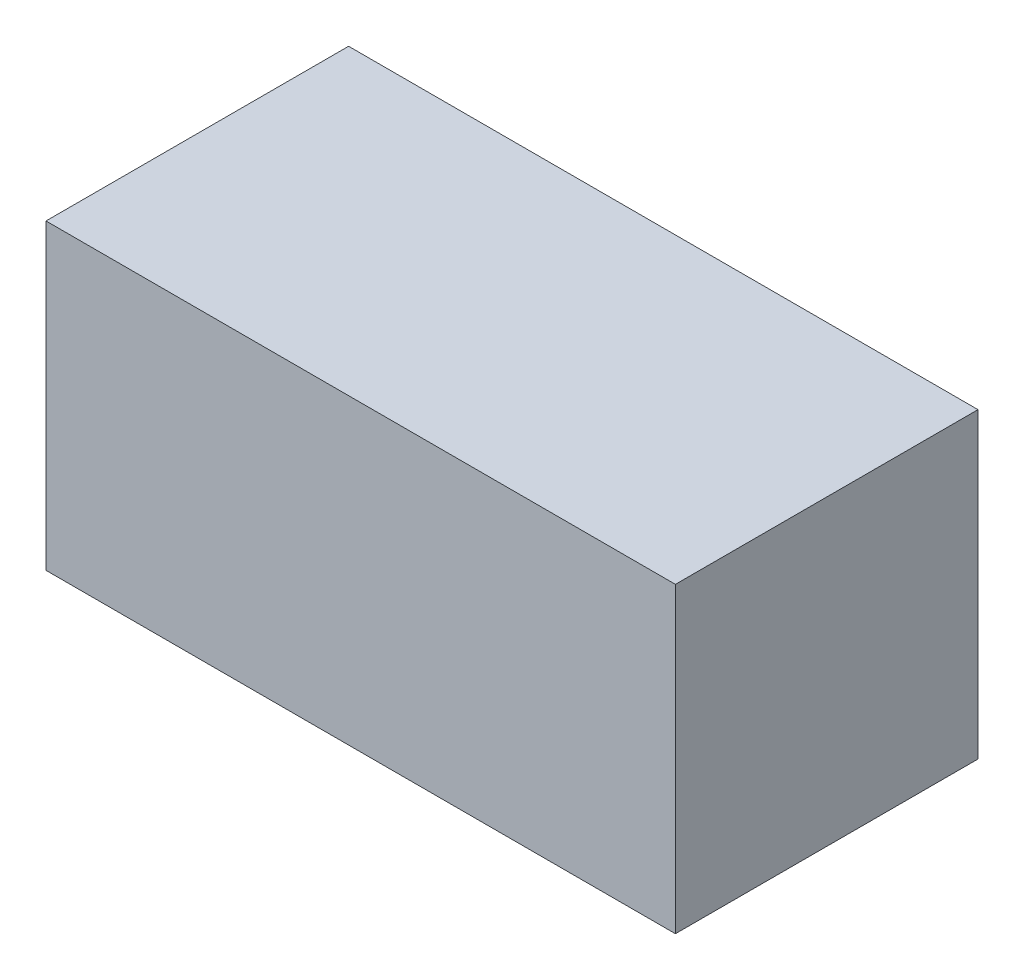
ISO-10303-21;
HEADER;
FILE_DESCRIPTION(('STEP AP214'),'2;1');
FILE_NAME('part.step','',(''),(''),'','','');
FILE_SCHEMA(('AUTOMOTIVE_DESIGN { 1 0 10303 214 1 1 1 1 }'));
ENDSEC;
DATA;
#1=APPLICATION_CONTEXT('core data for automotive mechanical design processes');
#2=APPLICATION_PROTOCOL_DEFINITION('international standard','automotive_design',2000,#1);
#3=PRODUCT_CONTEXT('',#1,'mechanical');
#4=PRODUCT('Part','Part','',(#3));
#5=PRODUCT_RELATED_PRODUCT_CATEGORY('part','',(#4));
#6=PRODUCT_DEFINITION_FORMATION('','',#4);
#7=PRODUCT_DEFINITION_CONTEXT('part definition',#1,'design');
#8=PRODUCT_DEFINITION('design','',#6,#7);
#9=PRODUCT_DEFINITION_SHAPE('','',#8);
#10=(LENGTH_UNIT() NAMED_UNIT(*) SI_UNIT(.MILLI.,.METRE.));
#11=(NAMED_UNIT(*) PLANE_ANGLE_UNIT() SI_UNIT($,.RADIAN.));
#12=(NAMED_UNIT(*) SI_UNIT($,.STERADIAN.) SOLID_ANGLE_UNIT());
#13=UNCERTAINTY_MEASURE_WITH_UNIT(LENGTH_MEASURE(1.E-05),#10,'distance_accuracy_value','');
#14=(GEOMETRIC_REPRESENTATION_CONTEXT(3) GLOBAL_UNCERTAINTY_ASSIGNED_CONTEXT((#13)) GLOBAL_UNIT_ASSIGNED_CONTEXT((#10,
#11,#12)) REPRESENTATION_CONTEXT('',''));
#15=CARTESIAN_POINT('',(0.,0.,0.));
#16=DIRECTION('',(0.,0.,1.));
#17=DIRECTION('',(1.,0.,0.));
#18=AXIS2_PLACEMENT_3D('',#15,#16,#17);
#19=CARTESIAN_POINT('',(0.51999896,-0.2499995,0.));
#20=DIRECTION('',(0.,-1.,0.));
#21=DIRECTION('',(0.,0.,-1.));
#22=AXIS2_PLACEMENT_3D('',#19,#20,#21);
#23=PLANE('',#22);
#24=DIRECTION('',(0.,0.,1.));
#25=VECTOR('',#24,1.);
#26=CARTESIAN_POINT('',(-0.51999896,-0.2499995,0.));
#27=LINE('',#26,#25);
#28=CARTESIAN_POINT('',(-0.51999896,-0.2499995,0.));
#29=VERTEX_POINT('',#28);
#30=CARTESIAN_POINT('',(-0.51999896,-0.2499995,0.5));
#31=VERTEX_POINT('',#30);
#32=EDGE_CURVE('E20',#29,#31,#27,.T.);
#33=ORIENTED_EDGE('',*,*,#32,.F.);
#34=DIRECTION('',(1.,0.,0.));
#35=VECTOR('',#34,1.);
#36=CARTESIAN_POINT('',(-0.51999896,-0.2499995,0.));
#37=LINE('',#36,#35);
#38=CARTESIAN_POINT('',(0.51999896,-0.2499995,0.));
#39=VERTEX_POINT('',#38);
#40=EDGE_CURVE('E79',#29,#39,#37,.T.);
#41=ORIENTED_EDGE('',*,*,#40,.T.);
#42=DIRECTION('',(0.,0.,-1.));
#43=VECTOR('',#42,1.);
#44=CARTESIAN_POINT('',(0.51999896,-0.2499995,0.));
#45=LINE('',#44,#43);
#46=CARTESIAN_POINT('',(0.51999896,-0.2499995,0.5));
#47=VERTEX_POINT('',#46);
#48=EDGE_CURVE('E61',#47,#39,#45,.T.);
#49=ORIENTED_EDGE('',*,*,#48,.F.);
#50=DIRECTION('',(1.,0.,0.));
#51=VECTOR('',#50,1.);
#52=CARTESIAN_POINT('',(-0.51999896,-0.2499995,0.5));
#53=LINE('',#52,#51);
#54=EDGE_CURVE('E56',#31,#47,#53,.T.);
#55=ORIENTED_EDGE('',*,*,#54,.F.);
#56=EDGE_LOOP('',(#33,#41,#49,#55));
#57=FACE_BOUND('',#56,.T.);
#58=ADVANCED_FACE('F17',(#57),#23,.T.);
#59=CARTESIAN_POINT('',(-0.51999896,-0.2499995,0.));
#60=DIRECTION('',(-1.,0.,0.));
#61=DIRECTION('',(0.,0.,1.));
#62=AXIS2_PLACEMENT_3D('',#59,#60,#61);
#63=PLANE('',#62);
#64=DIRECTION('',(0.,0.,1.));
#65=VECTOR('',#64,1.);
#66=CARTESIAN_POINT('',(-0.51999896,0.2499995,0.));
#67=LINE('',#66,#65);
#68=CARTESIAN_POINT('',(-0.51999896,0.2499995,0.));
#69=VERTEX_POINT('',#68);
#70=CARTESIAN_POINT('',(-0.51999896,0.2499995,0.5));
#71=VERTEX_POINT('',#70);
#72=EDGE_CURVE('E83',#69,#71,#67,.T.);
#73=ORIENTED_EDGE('',*,*,#72,.F.);
#74=DIRECTION('',(0.,1.,0.));
#75=VECTOR('',#74,1.);
#76=CARTESIAN_POINT('',(-0.51999896,-0.2499995,0.));
#77=LINE('',#76,#75);
#78=EDGE_CURVE('E68',#69,#29,#77,.F.);
#79=ORIENTED_EDGE('',*,*,#78,.T.);
#80=ORIENTED_EDGE('',*,*,#32,.T.);
#81=DIRECTION('',(0.,1.,0.));
#82=VECTOR('',#81,1.);
#83=CARTESIAN_POINT('',(-0.51999896,-0.2499995,0.5));
#84=LINE('',#83,#82);
#85=EDGE_CURVE('E63',#71,#31,#84,.F.);
#86=ORIENTED_EDGE('',*,*,#85,.F.);
#87=EDGE_LOOP('',(#73,#79,#80,#86));
#88=FACE_BOUND('',#87,.T.);
#89=ADVANCED_FACE('F65',(#88),#63,.T.);
#90=CARTESIAN_POINT('',(-0.51999896,-0.2499995,0.5));
#91=DIRECTION('',(0.,0.,1.));
#92=DIRECTION('',(1.,0.,0.));
#93=AXIS2_PLACEMENT_3D('',#90,#91,#92);
#94=PLANE('',#93);
#95=DIRECTION('',(1.,0.,0.));
#96=VECTOR('',#95,1.);
#97=CARTESIAN_POINT('',(-0.51999896,0.2499995,0.5));
#98=LINE('',#97,#96);
#99=CARTESIAN_POINT('',(0.51999896,0.2499995,0.5));
#100=VERTEX_POINT('',#99);
#101=EDGE_CURVE('E72',#71,#100,#98,.T.);
#102=ORIENTED_EDGE('',*,*,#101,.F.);
#103=ORIENTED_EDGE('',*,*,#85,.T.);
#104=ORIENTED_EDGE('',*,*,#54,.T.);
#105=DIRECTION('',(0.,1.,0.));
#106=VECTOR('',#105,1.);
#107=CARTESIAN_POINT('',(0.51999896,0.2499995,0.5));
#108=LINE('',#107,#106);
#109=EDGE_CURVE('E74',#100,#47,#108,.F.);
#110=ORIENTED_EDGE('',*,*,#109,.F.);
#111=EDGE_LOOP('',(#102,#103,#104,#110));
#112=FACE_BOUND('',#111,.T.);
#113=ADVANCED_FACE('F70',(#112),#94,.T.);
#114=CARTESIAN_POINT('',(0.51999896,0.2499995,0.));
#115=DIRECTION('',(1.,0.,0.));
#116=DIRECTION('',(0.,0.,-1.));
#117=AXIS2_PLACEMENT_3D('',#114,#115,#116);
#118=PLANE('',#117);
#119=ORIENTED_EDGE('',*,*,#48,.T.);
#120=DIRECTION('',(0.,1.,0.));
#121=VECTOR('',#120,1.);
#122=CARTESIAN_POINT('',(0.51999896,-0.2499995,0.));
#123=LINE('',#122,#121);
#124=CARTESIAN_POINT('',(0.51999896,0.2499995,0.));
#125=VERTEX_POINT('',#124);
#126=EDGE_CURVE('E35',#39,#125,#123,.T.);
#127=ORIENTED_EDGE('',*,*,#126,.T.);
#128=DIRECTION('',(0.,0.,1.));
#129=VECTOR('',#128,1.);
#130=CARTESIAN_POINT('',(0.51999896,0.2499995,0.));
#131=LINE('',#130,#129);
#132=EDGE_CURVE('E26',#100,#125,#131,.F.);
#133=ORIENTED_EDGE('',*,*,#132,.F.);
#134=ORIENTED_EDGE('',*,*,#109,.T.);
#135=EDGE_LOOP('',(#119,#127,#133,#134));
#136=FACE_BOUND('',#135,.T.);
#137=ADVANCED_FACE('F89',(#136),#118,.T.);
#138=CARTESIAN_POINT('',(-0.51999896,-0.2499995,0.));
#139=DIRECTION('',(0.,0.,1.));
#140=DIRECTION('',(1.,0.,0.));
#141=AXIS2_PLACEMENT_3D('',#138,#139,#140);
#142=PLANE('',#141);
#143=DIRECTION('',(1.,0.,0.));
#144=VECTOR('',#143,1.);
#145=CARTESIAN_POINT('',(-0.51999896,0.2499995,0.));
#146=LINE('',#145,#144);
#147=EDGE_CURVE('E11',#125,#69,#146,.F.);
#148=ORIENTED_EDGE('',*,*,#147,.F.);
#149=ORIENTED_EDGE('',*,*,#126,.F.);
#150=ORIENTED_EDGE('',*,*,#40,.F.);
#151=ORIENTED_EDGE('',*,*,#78,.F.);
#152=EDGE_LOOP('',(#148,#149,#150,#151));
#153=FACE_BOUND('',#152,.T.);
#154=ADVANCED_FACE('F91',(#153),#142,.F.);
#155=CARTESIAN_POINT('',(-0.51999896,0.2499995,0.));
#156=DIRECTION('',(0.,1.,0.));
#157=DIRECTION('',(0.,0.,1.));
#158=AXIS2_PLACEMENT_3D('',#155,#156,#157);
#159=PLANE('',#158);
#160=ORIENTED_EDGE('',*,*,#132,.T.);
#161=ORIENTED_EDGE('',*,*,#147,.T.);
#162=ORIENTED_EDGE('',*,*,#72,.T.);
#163=ORIENTED_EDGE('',*,*,#101,.T.);
#164=EDGE_LOOP('',(#160,#161,#162,#163));
#165=FACE_BOUND('',#164,.T.);
#166=ADVANCED_FACE('F88',(#165),#159,.T.);
#167=CLOSED_SHELL('',(#58,#89,#113,#137,#154,#166));
#168=MANIFOLD_SOLID_BREP('B1',#167);
#169=ADVANCED_BREP_SHAPE_REPRESENTATION('',(#18,#168),#14);
#170=SHAPE_DEFINITION_REPRESENTATION(#9,#169);
ENDSEC;
END-ISO-10303-21;
